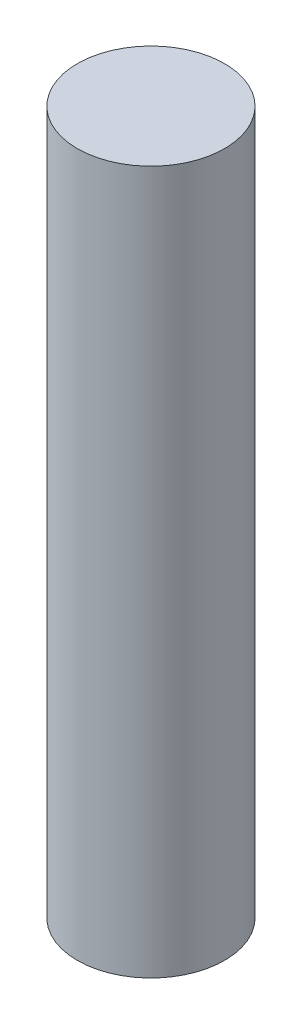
ISO-10303-21;
HEADER;
FILE_DESCRIPTION(('STEP AP214'),'2;1');
FILE_NAME('part.step','',(''),(''),'','','');
FILE_SCHEMA(('AUTOMOTIVE_DESIGN { 1 0 10303 214 1 1 1 1 }'));
ENDSEC;
DATA;
#1=APPLICATION_CONTEXT('core data for automotive mechanical design processes');
#2=APPLICATION_PROTOCOL_DEFINITION('international standard','automotive_design',2000,#1);
#3=PRODUCT_CONTEXT('',#1,'mechanical');
#4=PRODUCT('Part','Part','',(#3));
#5=PRODUCT_RELATED_PRODUCT_CATEGORY('part','',(#4));
#6=PRODUCT_DEFINITION_FORMATION('','',#4);
#7=PRODUCT_DEFINITION_CONTEXT('part definition',#1,'design');
#8=PRODUCT_DEFINITION('design','',#6,#7);
#9=PRODUCT_DEFINITION_SHAPE('','',#8);
#10=(LENGTH_UNIT() NAMED_UNIT(*) SI_UNIT(.MILLI.,.METRE.));
#11=(NAMED_UNIT(*) PLANE_ANGLE_UNIT() SI_UNIT($,.RADIAN.));
#12=(NAMED_UNIT(*) SI_UNIT($,.STERADIAN.) SOLID_ANGLE_UNIT());
#13=UNCERTAINTY_MEASURE_WITH_UNIT(LENGTH_MEASURE(1.E-05),#10,'distance_accuracy_value','');
#14=(GEOMETRIC_REPRESENTATION_CONTEXT(3) GLOBAL_UNCERTAINTY_ASSIGNED_CONTEXT((#13)) GLOBAL_UNIT_ASSIGNED_CONTEXT((#10,
#11,#12)) REPRESENTATION_CONTEXT('',''));
#15=CARTESIAN_POINT('',(0.,0.,0.));
#16=DIRECTION('',(0.,0.,1.));
#17=DIRECTION('',(1.,0.,0.));
#18=AXIS2_PLACEMENT_3D('',#15,#16,#17);
#19=CARTESIAN_POINT('',(0.,9.5,0.));
#20=DIRECTION('',(0.,-1.,0.));
#21=DIRECTION('',(0.,0.,-1.));
#22=AXIS2_PLACEMENT_3D('',#19,#20,#21);
#23=CYLINDRICAL_SURFACE('',#22,0.995);
#24=CARTESIAN_POINT('',(0.,9.5,0.));
#25=DIRECTION('',(0.,1.,0.));
#26=DIRECTION('',(0.,0.,1.));
#27=AXIS2_PLACEMENT_3D('',#24,#25,#26);
#28=CIRCLE('',#27,0.995);
#29=CARTESIAN_POINT('',(0.,9.5,0.995));
#30=VERTEX_POINT('',#29);
#31=EDGE_CURVE('E10',#30,#30,#28,.T.);
#32=ORIENTED_EDGE('',*,*,#31,.F.);
#33=EDGE_LOOP('',(#32));
#34=FACE_BOUND('',#33,.T.);
#35=CARTESIAN_POINT('',(0.,0.,0.));
#36=DIRECTION('',(0.,1.,0.));
#37=DIRECTION('',(0.,0.,1.));
#38=AXIS2_PLACEMENT_3D('',#35,#36,#37);
#39=CIRCLE('',#38,0.995);
#40=CARTESIAN_POINT('',(0.,0.,0.995));
#41=VERTEX_POINT('',#40);
#42=EDGE_CURVE('E46',#41,#41,#39,.T.);
#43=ORIENTED_EDGE('',*,*,#42,.T.);
#44=EDGE_LOOP('',(#43));
#45=FACE_BOUND('',#44,.T.);
#46=ADVANCED_FACE('F43',(#34,#45),#23,.T.);
#47=CARTESIAN_POINT('',(0.,9.5,0.));
#48=DIRECTION('',(0.,1.,0.));
#49=DIRECTION('',(0.,0.,1.));
#50=AXIS2_PLACEMENT_3D('',#47,#48,#49);
#51=PLANE('',#50);
#52=ORIENTED_EDGE('',*,*,#31,.T.);
#53=EDGE_LOOP('',(#52));
#54=FACE_BOUND('',#53,.T.);
#55=ADVANCED_FACE('F60',(#54),#51,.T.);
#56=CARTESIAN_POINT('',(0.,0.,0.));
#57=DIRECTION('',(0.,1.,0.));
#58=DIRECTION('',(0.,0.,1.));
#59=AXIS2_PLACEMENT_3D('',#56,#57,#58);
#60=PLANE('',#59);
#61=ORIENTED_EDGE('',*,*,#42,.F.);
#62=EDGE_LOOP('',(#61));
#63=FACE_BOUND('',#62,.T.);
#64=ADVANCED_FACE('F58',(#63),#60,.F.);
#65=CLOSED_SHELL('',(#46,#55,#64));
#66=MANIFOLD_SOLID_BREP('B2',#65);
#67=ADVANCED_BREP_SHAPE_REPRESENTATION('',(#18,#66),#14);
#68=SHAPE_DEFINITION_REPRESENTATION(#9,#67);
ENDSEC;
END-ISO-10303-21;
